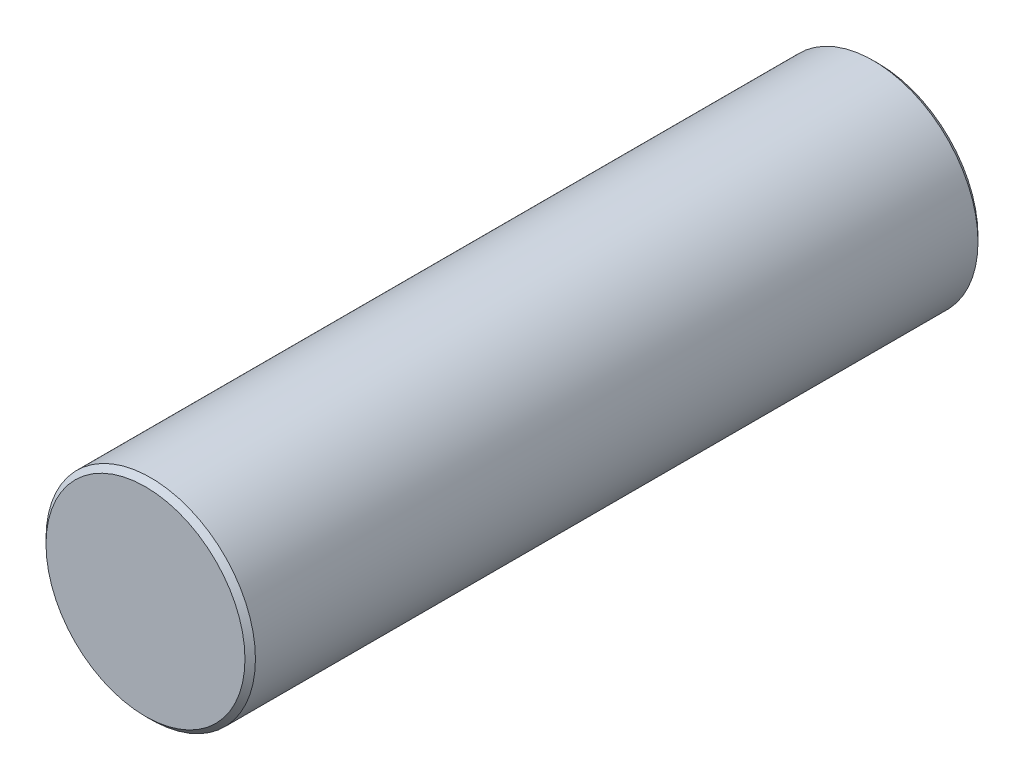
ISO-10303-21;
HEADER;
FILE_DESCRIPTION(('STEP AP214'),'2;1');
FILE_NAME('part.step','',(''),(''),'','','');
FILE_SCHEMA(('AUTOMOTIVE_DESIGN { 1 0 10303 214 1 1 1 1 }'));
ENDSEC;
DATA;
#1=APPLICATION_CONTEXT('core data for automotive mechanical design processes');
#2=APPLICATION_PROTOCOL_DEFINITION('international standard','automotive_design',2000,#1);
#3=PRODUCT_CONTEXT('',#1,'mechanical');
#4=PRODUCT('Part','Part','',(#3));
#5=PRODUCT_RELATED_PRODUCT_CATEGORY('part','',(#4));
#6=PRODUCT_DEFINITION_FORMATION('','',#4);
#7=PRODUCT_DEFINITION_CONTEXT('part definition',#1,'design');
#8=PRODUCT_DEFINITION('design','',#6,#7);
#9=PRODUCT_DEFINITION_SHAPE('','',#8);
#10=(LENGTH_UNIT() NAMED_UNIT(*) SI_UNIT(.MILLI.,.METRE.));
#11=(NAMED_UNIT(*) PLANE_ANGLE_UNIT() SI_UNIT($,.RADIAN.));
#12=(NAMED_UNIT(*) SI_UNIT($,.STERADIAN.) SOLID_ANGLE_UNIT());
#13=UNCERTAINTY_MEASURE_WITH_UNIT(LENGTH_MEASURE(1.E-05),#10,'distance_accuracy_value','');
#14=(GEOMETRIC_REPRESENTATION_CONTEXT(3) GLOBAL_UNCERTAINTY_ASSIGNED_CONTEXT((#13)) GLOBAL_UNIT_ASSIGNED_CONTEXT((#10,
#11,#12)) REPRESENTATION_CONTEXT('',''));
#15=CARTESIAN_POINT('',(0.,0.,0.));
#16=DIRECTION('',(0.,0.,1.));
#17=DIRECTION('',(1.,0.,0.));
#18=AXIS2_PLACEMENT_3D('',#15,#16,#17);
#19=CARTESIAN_POINT('',(0.,0.,-14.));
#20=DIRECTION('',(0.,0.,1.));
#21=DIRECTION('',(1.,0.,0.));
#22=AXIS2_PLACEMENT_3D('',#19,#20,#21);
#23=CYLINDRICAL_SURFACE('',#22,2.);
#24=CARTESIAN_POINT('',(0.,0.,-0.1));
#25=DIRECTION('',(0.,0.,1.));
#26=DIRECTION('',(1.,0.,0.));
#27=AXIS2_PLACEMENT_3D('',#24,#25,#26);
#28=CIRCLE('',#27,2.);
#29=CARTESIAN_POINT('',(2.,0.,-0.1));
#30=VERTEX_POINT('',#29);
#31=EDGE_CURVE('E35',#30,#30,#28,.F.);
#32=ORIENTED_EDGE('',*,*,#31,.T.);
#33=EDGE_LOOP('',(#32));
#34=FACE_BOUND('',#33,.T.);
#35=CARTESIAN_POINT('',(0.,0.,-13.9));
#36=DIRECTION('',(0.,0.,1.));
#37=DIRECTION('',(1.,0.,0.));
#38=AXIS2_PLACEMENT_3D('',#35,#36,#37);
#39=CIRCLE('',#38,2.);
#40=CARTESIAN_POINT('',(2.,0.,-13.9));
#41=VERTEX_POINT('',#40);
#42=EDGE_CURVE('E39',#41,#41,#39,.T.);
#43=ORIENTED_EDGE('',*,*,#42,.T.);
#44=EDGE_LOOP('',(#43));
#45=FACE_BOUND('',#44,.T.);
#46=ADVANCED_FACE('F29',(#34,#45),#23,.T.);
#47=CARTESIAN_POINT('',(0.,0.,-14.));
#48=DIRECTION('',(0.,0.,1.));
#49=DIRECTION('',(1.,0.,0.));
#50=AXIS2_PLACEMENT_3D('',#47,#48,#49);
#51=PLANE('',#50);
#52=CARTESIAN_POINT('',(0.,0.,-14.));
#53=DIRECTION('',(0.,0.,1.));
#54=DIRECTION('',(1.,0.,0.));
#55=AXIS2_PLACEMENT_3D('',#52,#53,#54);
#56=CIRCLE('',#55,1.9);
#57=CARTESIAN_POINT('',(1.9,0.,-14.));
#58=VERTEX_POINT('',#57);
#59=EDGE_CURVE('E10',#58,#58,#56,.F.);
#60=ORIENTED_EDGE('',*,*,#59,.T.);
#61=EDGE_LOOP('',(#60));
#62=FACE_BOUND('',#61,.T.);
#63=ADVANCED_FACE('F62',(#62),#51,.F.);
#64=CARTESIAN_POINT('',(0.,0.,0.));
#65=DIRECTION('',(0.,0.,1.));
#66=DIRECTION('',(1.,0.,0.));
#67=AXIS2_PLACEMENT_3D('',#64,#65,#66);
#68=PLANE('',#67);
#69=CARTESIAN_POINT('',(0.,0.,0.));
#70=DIRECTION('',(0.,0.,1.));
#71=DIRECTION('',(1.,0.,0.));
#72=AXIS2_PLACEMENT_3D('',#69,#70,#71);
#73=CIRCLE('',#72,1.9);
#74=CARTESIAN_POINT('',(1.9,0.,0.));
#75=VERTEX_POINT('',#74);
#76=EDGE_CURVE('E43',#75,#75,#73,.T.);
#77=ORIENTED_EDGE('',*,*,#76,.T.);
#78=EDGE_LOOP('',(#77));
#79=FACE_BOUND('',#78,.T.);
#80=ADVANCED_FACE('F49',(#79),#68,.T.);
#81=CARTESIAN_POINT('',(0.,0.,0.));
#82=DIRECTION('',(0.,0.,-1.));
#83=DIRECTION('',(-1.,0.,0.));
#84=AXIS2_PLACEMENT_3D('',#81,#82,#83);
#85=CONICAL_SURFACE('',#84,1.9,0.785398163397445);
#86=ORIENTED_EDGE('',*,*,#31,.F.);
#87=EDGE_LOOP('',(#86));
#88=FACE_BOUND('',#87,.T.);
#89=ORIENTED_EDGE('',*,*,#76,.F.);
#90=EDGE_LOOP('',(#89));
#91=FACE_BOUND('',#90,.T.);
#92=ADVANCED_FACE('F51',(#88,#91),#85,.T.);
#93=CARTESIAN_POINT('',(0.,0.,-13.9));
#94=DIRECTION('',(0.,0.,1.));
#95=DIRECTION('',(1.,0.,0.));
#96=AXIS2_PLACEMENT_3D('',#93,#94,#95);
#97=CONICAL_SURFACE('',#96,2.,0.785398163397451);
#98=ORIENTED_EDGE('',*,*,#59,.F.);
#99=EDGE_LOOP('',(#98));
#100=FACE_BOUND('',#99,.T.);
#101=ORIENTED_EDGE('',*,*,#42,.F.);
#102=EDGE_LOOP('',(#101));
#103=FACE_BOUND('',#102,.T.);
#104=ADVANCED_FACE('F53',(#100,#103),#97,.T.);
#105=CLOSED_SHELL('',(#46,#63,#80,#92,#104));
#106=MANIFOLD_SOLID_BREP('B2',#105);
#107=ADVANCED_BREP_SHAPE_REPRESENTATION('',(#18,#106),#14);
#108=SHAPE_DEFINITION_REPRESENTATION(#9,#107);
ENDSEC;
END-ISO-10303-21;
